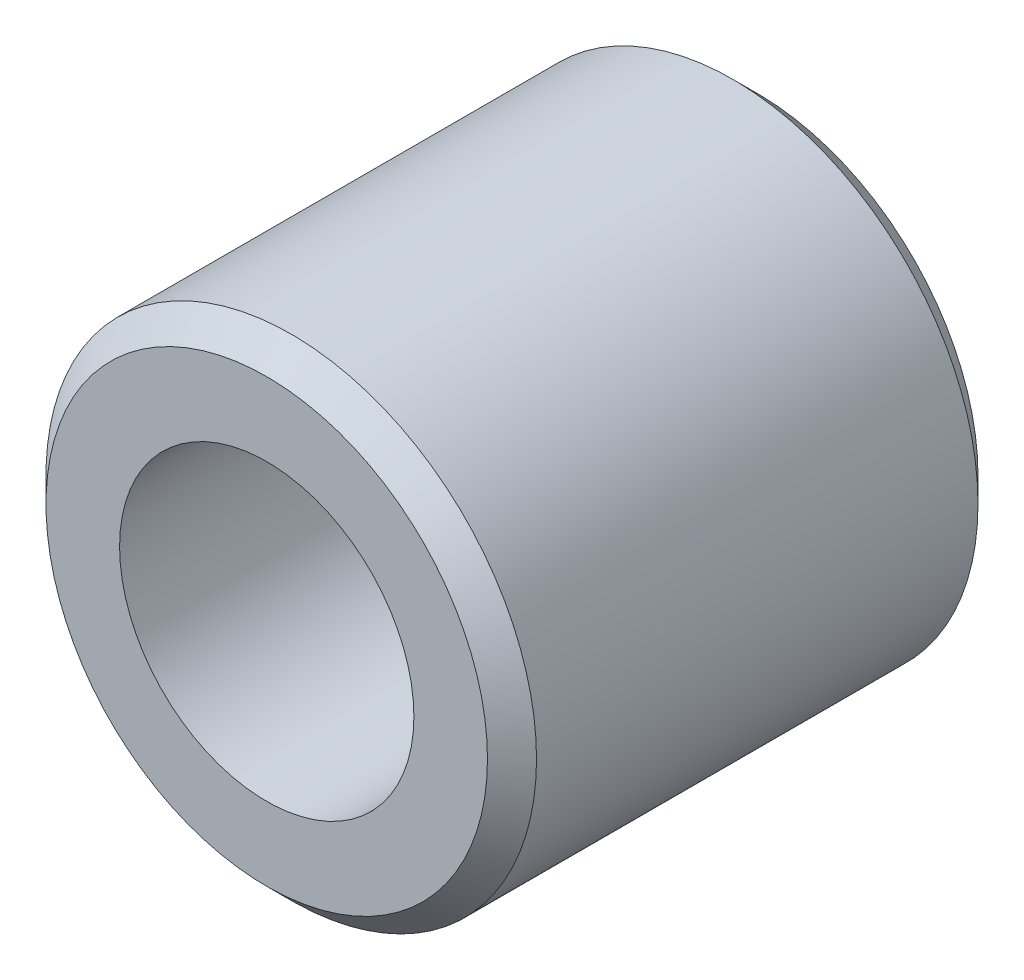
from build123d import *

# Parameters (mm, degrees)
ESQUISSE1_R      = 5
ESQUISSE1_R_2    = 3
EXTRUSION1_DEPTH = 10
CHANFREIN1_SIZE  = 0.5


with BuildPart() as part:
    # Esquisse1 → Extrusion1 (new body)
    with BuildSketch(Plane.XY):
        Circle(ESQUISSE1_R)
        Circle(ESQUISSE1_R_2, mode=Mode.SUBTRACT)
    extrude(amount=EXTRUSION1_DEPTH)

    # Chanfrein1
    chanfrein1_edges = [part.edges().sort_by_distance(p)[0] for p in [
        (-5, 0, 0),
        (-5, 0, 10),
    ]]
    chamfer(chanfrein1_edges, length=CHANFREIN1_SIZE)


solid = part.part
